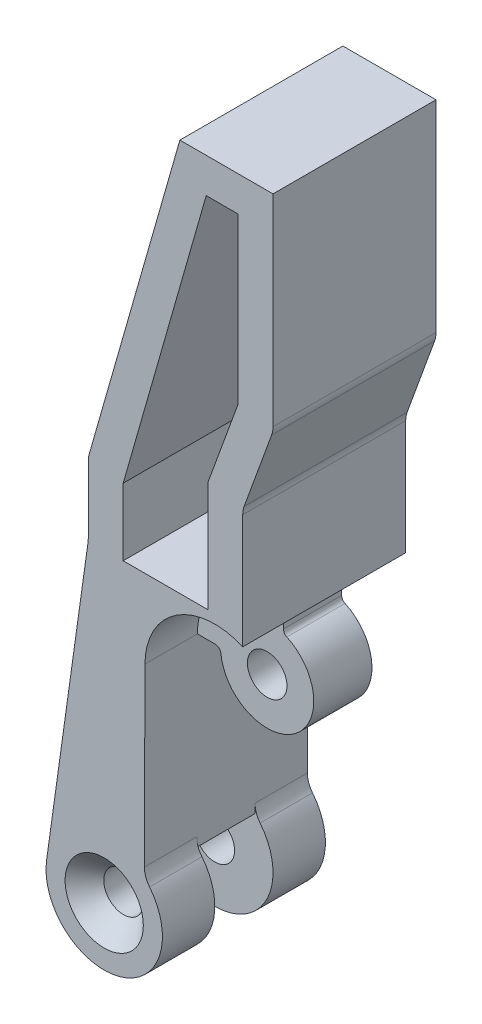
from build123d import *

# Parameters (mm, degrees)
BOSS_EXTRUDE1_DEPTH                                  = 7
CUT_EXTRUDE1_DEPTH                                   = 64.294944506
CUT_EXTRUDE1_DEPTH_BACK                              = 64.294944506
BOSS_EXTRUDE2_DEPTH                                  = 2.5
SKETCH4_R                                            = 5
CUT_EXTRUDE2_DEPTH                                   = 2.5
SKETCH6_W                                            = 1.7
SKETCH6_H                                            = 9.500025
M3_CLEARANCE_HOLE1_AT_2_COUNT                        = 2
M3_CLEARANCE_HOLE1_AT_2_PITCH                        = 21.691011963
CSK_FOR_M3_HEX_SOCKET_COUNTERSUNK_CAP_SC_D           = 3.4
CSK_FOR_M3_HEX_SOCKET_COUNTERSUNK_CAP_SC_CSINK_D     = 6.72
CSK_FOR_M3_HEX_SOCKET_COUNTERSUNK_CAP_SC_CSINK_ANGLE = 90
FILLET1_R                                            = 2


with BuildPart() as part:
    # Sketch1 → Boss-Extrude1 (new, symmetric)
    with BuildSketch(Plane.XY):
        with BuildLine():
            Line((14.5, 60), (6.5, 60))
            Line((6.5, 60), (-1.369998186, 32.461736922))
            Line((-1.369998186, 32.461736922), (-1.369998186, 26.270646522))
            Line((-1.369998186, 26.270646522), (-4.95168551, 0.693405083))
            ThreePointArc((-4.95168551, 0.693405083), (1.64484588, -4.721703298), (3.449110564, 3.619894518))
            Line((3.449110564, 3.619894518), (3.500030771, 19.519215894))
            ThreePointArc((3.500030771, 19.519215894), (6.220755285, 24.524594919), (11.897915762, 25))
            Line((11.897915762, 25), (11.897915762, 35.181091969))
            Line((11.897915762, 35.181091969), (14.5, 42.325463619))
            Line((14.5, 42.325463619), (14.5, 60))
        make_face()
    extrude(amount=BOSS_EXTRUDE1_DEPTH, both=True)

    # Sketch2 → Cut-Extrude1 (cut, two sides: drawn at the far end of the back side and taken through both)
    with BuildSketch(Plane.XY.offset(7).offset(-CUT_EXTRUDE1_DEPTH_BACK)):
        Polygon((1.630001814, 26.270646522), (8.897915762, 26.270646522), (8.897915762, 35.710406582), (11.5, 42.854778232), (11.5, 57), (8.762752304, 57), (1.630001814, 32.041473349), align=None)
    extrude(amount=CUT_EXTRUDE1_DEPTH + CUT_EXTRUDE1_DEPTH_BACK, mode=Mode.SUBTRACT)

    # Sketch3 → Boss-Extrude2 (add, symmetric)
    with BuildSketch(Plane.XY):
        with BuildLine():
            Line((3.500030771, 19.519215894), (5.025757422, 19.519215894))
            ThreePointArc((5.025757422, 19.519215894), (5.359890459, 19.391177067), (5.522895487, 19.07263635))
            ThreePointArc((5.522895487, 19.07263635), (11.828138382, 16.247343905), (11.187036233, 23.126831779))
            ThreePointArc((11.187036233, 23.126831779), (10.976347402, 23.311336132), (10.897915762, 23.580185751))
            Line((10.897915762, 23.580185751), (10.897915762, 25.334880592))
            ThreePointArc((10.897915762, 25.334880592), (5.791872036, 24.216967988), (3.500030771, 19.519215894))
        make_face()
    extrude(amount=BOSS_EXTRUDE2_DEPTH, both=True)

    # Sketch4 → Cut-Extrude2 (cut, symmetric)
    with BuildSketch(Plane.XY):
        Circle(SKETCH4_R)
    extrude(amount=CUT_EXTRUDE2_DEPTH, both=True, mode=Mode.SUBTRACT)

    # Sketch6 → M3 Clearance Hole1 (revolve, cut)
    with BuildSketch(Plane(origin=(9.5, 19.5, 2.5), x_dir=(0, -1, 0), z_dir=(1, 0, 0))):
        with Locations((0.85, 4.7500125)):
            Rectangle(SKETCH6_W, SKETCH6_H)
    m3_clearance_hole1 = revolve(axis=Axis((9.5, 19.5, 8.85), (0, 0, -1)), mode=Mode.SUBTRACT)

    # M3 Clearance Hole1 at 2: M3 Clearance Hole1 ×2
    with Locations(*[Vector(-0.43796942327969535, -0.8989898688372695, 0) * (i * M3_CLEARANCE_HOLE1_AT_2_PITCH) for i in range(1, M3_CLEARANCE_HOLE1_AT_2_COUNT)]):
        add(m3_clearance_hole1, mode=Mode.SUBTRACT)

    # CSK for M3 Hex Socket Countersunk Cap Sc (through all)
    with Locations(Plane.XY.offset(7)):
        with Locations((0, 0)):
            CounterSinkHole(CSK_FOR_M3_HEX_SOCKET_COUNTERSUNK_CAP_SC_D / 2, CSK_FOR_M3_HEX_SOCKET_COUNTERSUNK_CAP_SC_CSINK_D / 2, counter_sink_angle=CSK_FOR_M3_HEX_SOCKET_COUNTERSUNK_CAP_SC_CSINK_ANGLE)

    # Fillet1
    fillet1_edges = [part.edges().sort_by_distance(p)[0] for p in [
        (3.449110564, 3.619894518, 4.75),
        (-1.369998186, 26.270646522, 0),
        (-1.369998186, 32.461736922, 0),
        (14.5, 42.325463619, 0),
        (11.897915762, 35.181091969, 0),
        (3.449110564, 3.619894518, -4.75),
    ]]
    fillet(fillet1_edges, radius=FILLET1_R)


solid = part.part
